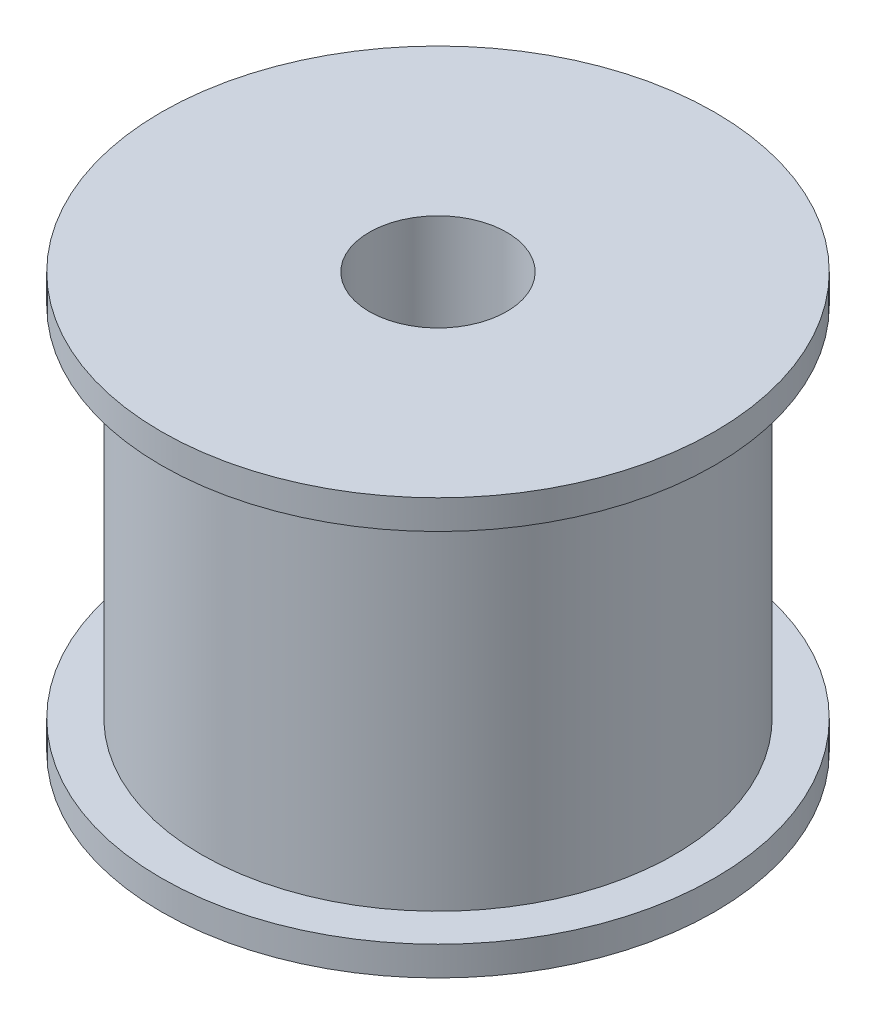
ISO-10303-21;
HEADER;
FILE_DESCRIPTION(('STEP AP214'),'2;1');
FILE_NAME('part.step','',(''),(''),'','','');
FILE_SCHEMA(('AUTOMOTIVE_DESIGN { 1 0 10303 214 1 1 1 1 }'));
ENDSEC;
DATA;
#1=APPLICATION_CONTEXT('core data for automotive mechanical design processes');
#2=APPLICATION_PROTOCOL_DEFINITION('international standard','automotive_design',2000,#1);
#3=PRODUCT_CONTEXT('',#1,'mechanical');
#4=PRODUCT('Part','Part','',(#3));
#5=PRODUCT_RELATED_PRODUCT_CATEGORY('part','',(#4));
#6=PRODUCT_DEFINITION_FORMATION('','',#4);
#7=PRODUCT_DEFINITION_CONTEXT('part definition',#1,'design');
#8=PRODUCT_DEFINITION('design','',#6,#7);
#9=PRODUCT_DEFINITION_SHAPE('','',#8);
#10=(LENGTH_UNIT() NAMED_UNIT(*) SI_UNIT(.MILLI.,.METRE.));
#11=(NAMED_UNIT(*) PLANE_ANGLE_UNIT() SI_UNIT($,.RADIAN.));
#12=(NAMED_UNIT(*) SI_UNIT($,.STERADIAN.) SOLID_ANGLE_UNIT());
#13=UNCERTAINTY_MEASURE_WITH_UNIT(LENGTH_MEASURE(1.E-05),#10,'distance_accuracy_value','');
#14=(GEOMETRIC_REPRESENTATION_CONTEXT(3) GLOBAL_UNCERTAINTY_ASSIGNED_CONTEXT((#13)) GLOBAL_UNIT_ASSIGNED_CONTEXT((#10,
#11,#12)) REPRESENTATION_CONTEXT('',''));
#15=CARTESIAN_POINT('',(0.,0.,0.));
#16=DIRECTION('',(0.,0.,1.));
#17=DIRECTION('',(1.,0.,0.));
#18=AXIS2_PLACEMENT_3D('',#15,#16,#17);
#19=CARTESIAN_POINT('',(16.1,12.1,0.));
#20=DIRECTION('',(0.,1.,0.));
#21=DIRECTION('',(0.,0.,1.));
#22=AXIS2_PLACEMENT_3D('',#19,#20,#21);
#23=PLANE('',#22);
#24=CARTESIAN_POINT('',(0.,12.1,0.));
#25=DIRECTION('',(0.,1.,0.));
#26=DIRECTION('',(0.,0.,1.));
#27=AXIS2_PLACEMENT_3D('',#24,#25,#26);
#28=CIRCLE('',#27,4.);
#29=CARTESIAN_POINT('',(0.,12.1,4.));
#30=VERTEX_POINT('',#29);
#31=EDGE_CURVE('E62',#30,#30,#28,.T.);
#32=ORIENTED_EDGE('',*,*,#31,.F.);
#33=EDGE_LOOP('',(#32));
#34=FACE_BOUND('',#33,.T.);
#35=CARTESIAN_POINT('',(0.,12.1,0.));
#36=DIRECTION('',(0.,-1.,0.));
#37=DIRECTION('',(0.,0.,-1.));
#38=AXIS2_PLACEMENT_3D('',#35,#36,#37);
#39=CIRCLE('',#38,16.1);
#40=CARTESIAN_POINT('',(0.,12.1,-16.1));
#41=VERTEX_POINT('',#40);
#42=EDGE_CURVE('E10',#41,#41,#39,.T.);
#43=ORIENTED_EDGE('',*,*,#42,.F.);
#44=EDGE_LOOP('',(#43));
#45=FACE_BOUND('',#44,.T.);
#46=ADVANCED_FACE('F39',(#34,#45),#23,.T.);
#47=CARTESIAN_POINT('',(0.,-21.0408913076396,0.));
#48=DIRECTION('',(0.,-1.,0.));
#49=DIRECTION('',(0.,0.,-1.));
#50=AXIS2_PLACEMENT_3D('',#47,#48,#49);
#51=CYLINDRICAL_SURFACE('',#50,16.1);
#52=ORIENTED_EDGE('',*,*,#42,.T.);
#53=EDGE_LOOP('',(#52));
#54=FACE_BOUND('',#53,.T.);
#55=CARTESIAN_POINT('',(0.,10.4,0.));
#56=DIRECTION('',(0.,-1.,0.));
#57=DIRECTION('',(0.,0.,-1.));
#58=AXIS2_PLACEMENT_3D('',#55,#56,#57);
#59=CIRCLE('',#58,16.1);
#60=CARTESIAN_POINT('',(0.,10.4,-16.1));
#61=VERTEX_POINT('',#60);
#62=EDGE_CURVE('E44',#61,#61,#59,.T.);
#63=ORIENTED_EDGE('',*,*,#62,.F.);
#64=EDGE_LOOP('',(#63));
#65=FACE_BOUND('',#64,.T.);
#66=ADVANCED_FACE('F85',(#54,#65),#51,.T.);
#67=CARTESIAN_POINT('',(13.75,10.4,0.));
#68=DIRECTION('',(0.,-1.,0.));
#69=DIRECTION('',(0.,0.,-1.));
#70=AXIS2_PLACEMENT_3D('',#67,#68,#69);
#71=PLANE('',#70);
#72=ORIENTED_EDGE('',*,*,#62,.T.);
#73=EDGE_LOOP('',(#72));
#74=FACE_BOUND('',#73,.T.);
#75=CARTESIAN_POINT('',(0.,10.4,0.));
#76=DIRECTION('',(0.,-1.,0.));
#77=DIRECTION('',(0.,0.,-1.));
#78=AXIS2_PLACEMENT_3D('',#75,#76,#77);
#79=CIRCLE('',#78,13.75);
#80=CARTESIAN_POINT('',(0.,10.4,-13.75));
#81=VERTEX_POINT('',#80);
#82=EDGE_CURVE('E47',#81,#81,#79,.T.);
#83=ORIENTED_EDGE('',*,*,#82,.F.);
#84=EDGE_LOOP('',(#83));
#85=FACE_BOUND('',#84,.T.);
#86=ADVANCED_FACE('F86',(#74,#85),#71,.T.);
#87=CARTESIAN_POINT('',(0.,-21.0408913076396,0.));
#88=DIRECTION('',(0.,-1.,0.));
#89=DIRECTION('',(0.,0.,-1.));
#90=AXIS2_PLACEMENT_3D('',#87,#88,#89);
#91=CYLINDRICAL_SURFACE('',#90,13.75);
#92=ORIENTED_EDGE('',*,*,#82,.T.);
#93=EDGE_LOOP('',(#92));
#94=FACE_BOUND('',#93,.T.);
#95=CARTESIAN_POINT('',(0.,-10.4,0.));
#96=DIRECTION('',(0.,-1.,0.));
#97=DIRECTION('',(0.,0.,-1.));
#98=AXIS2_PLACEMENT_3D('',#95,#96,#97);
#99=CIRCLE('',#98,13.75);
#100=CARTESIAN_POINT('',(0.,-10.4,-13.75));
#101=VERTEX_POINT('',#100);
#102=EDGE_CURVE('E52',#101,#101,#99,.T.);
#103=ORIENTED_EDGE('',*,*,#102,.F.);
#104=EDGE_LOOP('',(#103));
#105=FACE_BOUND('',#104,.T.);
#106=ADVANCED_FACE('F95',(#94,#105),#91,.T.);
#107=CARTESIAN_POINT('',(13.75,-10.4,0.));
#108=DIRECTION('',(0.,1.,0.));
#109=DIRECTION('',(0.,0.,1.));
#110=AXIS2_PLACEMENT_3D('',#107,#108,#109);
#111=PLANE('',#110);
#112=ORIENTED_EDGE('',*,*,#102,.T.);
#113=EDGE_LOOP('',(#112));
#114=FACE_BOUND('',#113,.T.);
#115=CARTESIAN_POINT('',(0.,-10.4,0.));
#116=DIRECTION('',(0.,-1.,0.));
#117=DIRECTION('',(0.,0.,-1.));
#118=AXIS2_PLACEMENT_3D('',#115,#116,#117);
#119=CIRCLE('',#118,16.1);
#120=CARTESIAN_POINT('',(0.,-10.4,-16.1));
#121=VERTEX_POINT('',#120);
#122=EDGE_CURVE('E59',#121,#121,#119,.T.);
#123=ORIENTED_EDGE('',*,*,#122,.F.);
#124=EDGE_LOOP('',(#123));
#125=FACE_BOUND('',#124,.T.);
#126=ADVANCED_FACE('F98',(#114,#125),#111,.T.);
#127=CARTESIAN_POINT('',(0.,-21.0408913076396,0.));
#128=DIRECTION('',(0.,-1.,0.));
#129=DIRECTION('',(0.,0.,-1.));
#130=AXIS2_PLACEMENT_3D('',#127,#128,#129);
#131=CYLINDRICAL_SURFACE('',#130,16.1);
#132=ORIENTED_EDGE('',*,*,#122,.T.);
#133=EDGE_LOOP('',(#132));
#134=FACE_BOUND('',#133,.T.);
#135=CARTESIAN_POINT('',(0.,-12.1,0.));
#136=DIRECTION('',(0.,-1.,0.));
#137=DIRECTION('',(0.,0.,-1.));
#138=AXIS2_PLACEMENT_3D('',#135,#136,#137);
#139=CIRCLE('',#138,16.1);
#140=CARTESIAN_POINT('',(0.,-12.1,-16.1));
#141=VERTEX_POINT('',#140);
#142=EDGE_CURVE('E63',#141,#141,#139,.T.);
#143=ORIENTED_EDGE('',*,*,#142,.F.);
#144=EDGE_LOOP('',(#143));
#145=FACE_BOUND('',#144,.T.);
#146=ADVANCED_FACE('F105',(#134,#145),#131,.T.);
#147=CARTESIAN_POINT('',(16.1,-12.1,0.));
#148=DIRECTION('',(0.,-1.,0.));
#149=DIRECTION('',(0.,0.,-1.));
#150=AXIS2_PLACEMENT_3D('',#147,#148,#149);
#151=PLANE('',#150);
#152=CARTESIAN_POINT('',(0.,-12.1,0.));
#153=DIRECTION('',(0.,1.,0.));
#154=DIRECTION('',(0.,0.,1.));
#155=AXIS2_PLACEMENT_3D('',#152,#153,#154);
#156=CIRCLE('',#155,4.);
#157=CARTESIAN_POINT('',(0.,-12.1,4.));
#158=VERTEX_POINT('',#157);
#159=EDGE_CURVE('E64',#158,#158,#156,.T.);
#160=ORIENTED_EDGE('',*,*,#159,.T.);
#161=EDGE_LOOP('',(#160));
#162=FACE_BOUND('',#161,.T.);
#163=ORIENTED_EDGE('',*,*,#142,.T.);
#164=EDGE_LOOP('',(#163));
#165=FACE_BOUND('',#164,.T.);
#166=ADVANCED_FACE('F72',(#162,#165),#151,.T.);
#167=CARTESIAN_POINT('',(0.,-12.1,0.));
#168=DIRECTION('',(0.,1.,0.));
#169=DIRECTION('',(0.,0.,1.));
#170=AXIS2_PLACEMENT_3D('',#167,#168,#169);
#171=CYLINDRICAL_SURFACE('',#170,4.);
#172=ORIENTED_EDGE('',*,*,#159,.F.);
#173=EDGE_LOOP('',(#172));
#174=FACE_BOUND('',#173,.T.);
#175=ORIENTED_EDGE('',*,*,#31,.T.);
#176=EDGE_LOOP('',(#175));
#177=FACE_BOUND('',#176,.T.);
#178=ADVANCED_FACE('F74',(#174,#177),#171,.F.);
#179=CLOSED_SHELL('',(#46,#66,#86,#106,#126,#146,#166,#178));
#180=MANIFOLD_SOLID_BREP('B2',#179);
#181=ADVANCED_BREP_SHAPE_REPRESENTATION('',(#18,#180),#14);
#182=SHAPE_DEFINITION_REPRESENTATION(#9,#181);
ENDSEC;
END-ISO-10303-21;
